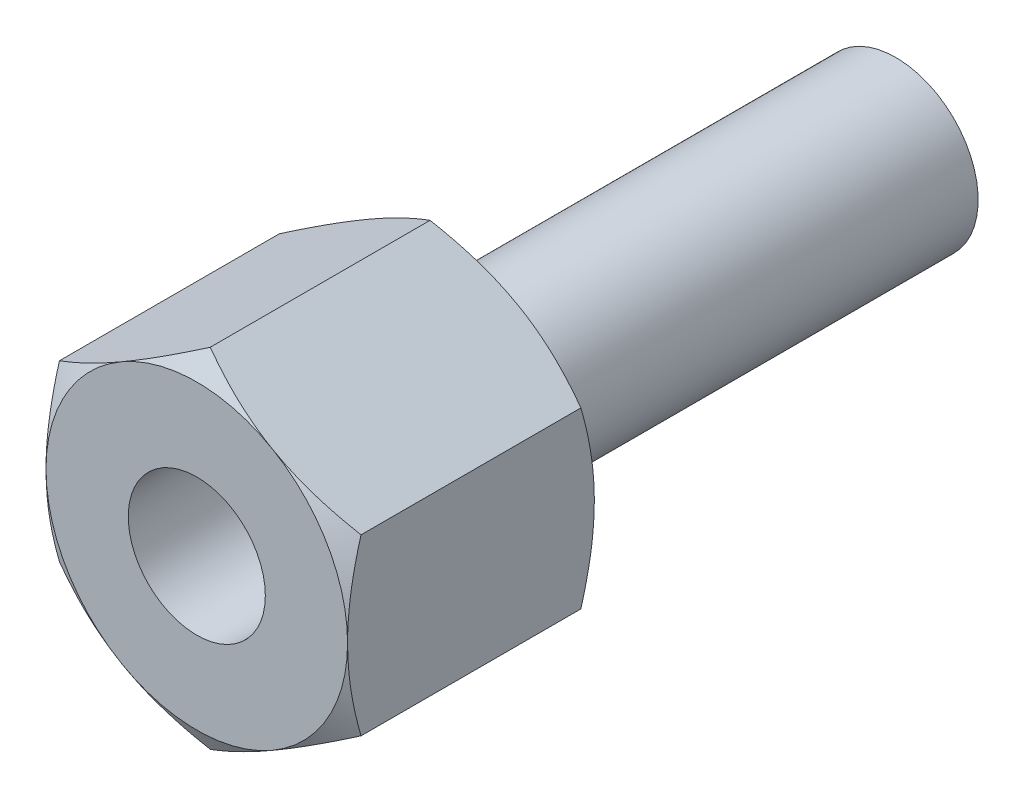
ISO-10303-21;
HEADER;
FILE_DESCRIPTION(('STEP AP214'),'2;1');
FILE_NAME('part.step','',(''),(''),'','','');
FILE_SCHEMA(('AUTOMOTIVE_DESIGN { 1 0 10303 214 1 1 1 1 }'));
ENDSEC;
DATA;
#1=APPLICATION_CONTEXT('core data for automotive mechanical design processes');
#2=APPLICATION_PROTOCOL_DEFINITION('international standard','automotive_design',2000,#1);
#3=PRODUCT_CONTEXT('',#1,'mechanical');
#4=PRODUCT('Part','Part','',(#3));
#5=PRODUCT_RELATED_PRODUCT_CATEGORY('part','',(#4));
#6=PRODUCT_DEFINITION_FORMATION('','',#4);
#7=PRODUCT_DEFINITION_CONTEXT('part definition',#1,'design');
#8=PRODUCT_DEFINITION('design','',#6,#7);
#9=PRODUCT_DEFINITION_SHAPE('','',#8);
#10=(LENGTH_UNIT() NAMED_UNIT(*) SI_UNIT(.MILLI.,.METRE.));
#11=(NAMED_UNIT(*) PLANE_ANGLE_UNIT() SI_UNIT($,.RADIAN.));
#12=(NAMED_UNIT(*) SI_UNIT($,.STERADIAN.) SOLID_ANGLE_UNIT());
#13=UNCERTAINTY_MEASURE_WITH_UNIT(LENGTH_MEASURE(1.E-05),#10,'distance_accuracy_value','');
#14=(GEOMETRIC_REPRESENTATION_CONTEXT(3) GLOBAL_UNCERTAINTY_ASSIGNED_CONTEXT((#13)) GLOBAL_UNIT_ASSIGNED_CONTEXT((#10,
#11,#12)) REPRESENTATION_CONTEXT('',''));
#15=CARTESIAN_POINT('',(0.,0.,0.));
#16=DIRECTION('',(0.,0.,1.));
#17=DIRECTION('',(1.,0.,0.));
#18=AXIS2_PLACEMENT_3D('',#15,#16,#17);
#19=CARTESIAN_POINT('',(0.,12.7017059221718,18.));
#20=DIRECTION('',(0.5,-0.866025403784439,0.));
#21=DIRECTION('',(0.866025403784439,0.5,0.));
#22=AXIS2_PLACEMENT_3D('',#19,#20,#21);
#23=PLANE('',#22);
#24=CARTESIAN_POINT('',(-11.0002,6.35073749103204,0.982547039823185));
#25=CARTESIAN_POINT('',(-10.7583962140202,6.49034297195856,0.901959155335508));
#26=CARTESIAN_POINT('',(-10.515690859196,6.63046897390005,0.825028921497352));
#27=CARTESIAN_POINT('',(-10.0283338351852,6.91184468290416,0.679498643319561));
#28=CARTESIAN_POINT('',(-9.78368155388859,7.05309474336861,0.61090133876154));
#29=CARTESIAN_POINT('',(-9.04578263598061,7.47912088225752,0.418936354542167));
#30=CARTESIAN_POINT('',(-8.54962304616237,7.76557875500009,0.309747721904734));
#31=CARTESIAN_POINT('',(-7.80714296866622,8.19424982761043,0.181714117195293));
#32=CARTESIAN_POINT('',(-7.56304065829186,8.33518236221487,0.145242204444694));
#33=CARTESIAN_POINT('',(-7.07370581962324,8.61769996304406,0.084081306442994));
#34=CARTESIAN_POINT('',(-6.82847326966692,8.7592850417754,0.0593925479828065));
#35=CARTESIAN_POINT('',(-6.33759931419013,9.0426912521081,0.0224303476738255));
#36=CARTESIAN_POINT('',(-6.0919587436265,9.1845119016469,0.0101421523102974));
#37=CARTESIAN_POINT('',(-5.60044998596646,9.46828461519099,-0.0017570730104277));
#38=CARTESIAN_POINT('',(-5.35458180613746,9.61023667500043,-0.00136849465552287));
#39=CARTESIAN_POINT('',(-4.89492981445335,9.87561687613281,0.0112011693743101));
#40=CARTESIAN_POINT('',(-4.68111322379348,9.99906394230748,0.0218490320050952));
#41=CARTESIAN_POINT('',(-4.25397181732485,10.2456741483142,0.0525316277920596));
#42=CARTESIAN_POINT('',(-4.04064703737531,10.3688372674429,0.0725670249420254));
#43=CARTESIAN_POINT('',(-3.6146051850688,10.6148126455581,0.121675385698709));
#44=CARTESIAN_POINT('',(-3.4018887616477,10.7376245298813,0.150755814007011));
#45=CARTESIAN_POINT('',(-2.97745318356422,10.9826725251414,0.217443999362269));
#46=CARTESIAN_POINT('',(-2.76573409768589,11.1049085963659,0.255052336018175));
#47=CARTESIAN_POINT('',(-2.12304886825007,11.4759630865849,0.381619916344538));
#48=CARTESIAN_POINT('',(-1.69394387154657,11.7237069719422,0.48319945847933));
#49=CARTESIAN_POINT('',(-0.842132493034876,12.2155005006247,0.713743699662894));
#50=CARTESIAN_POINT('',(-0.419415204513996,12.4595564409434,0.842654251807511));
#51=CARTESIAN_POINT('',(0.000200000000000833,12.7018213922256,0.982547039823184));
#52=B_SPLINE_CURVE_WITH_KNOTS('',3,(#24,#25,#26,#27,#28,#29,#30,#31,#32,#33,#34,#35,#36,#37,#38,
#39,#40,#41,#42,#43,#44,#45,#46,#47,#48,#49,#50,#51),.UNSPECIFIED.,.F.,.F.,(4,2,2,2,2,2,2,2,2,2,
2,2,2,4),(0.,0.871755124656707,1.74379610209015,3.49159027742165,4.34403665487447,
5.19649943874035,6.0479468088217,6.89936787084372,7.64056020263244,8.38180496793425,
9.1236630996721,9.86557166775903,11.3820155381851,12.8954827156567),.UNSPECIFIED.);
#53=CARTESIAN_POINT('',(-11.,6.35085296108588,0.982480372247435));
#54=VERTEX_POINT('',#53);
#55=CARTESIAN_POINT('',(-5.5,9.52627944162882,0.));
#56=VERTEX_POINT('',#55);
#57=EDGE_CURVE('E319',#54,#56,#52,.T.);
#58=ORIENTED_EDGE('',*,*,#57,.F.);
#59=DIRECTION('',(0.,0.,-1.));
#60=VECTOR('',#59,1.);
#61=CARTESIAN_POINT('',(-11.,6.35085296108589,18.));
#62=LINE('',#61,#60);
#63=CARTESIAN_POINT('',(-11.,6.35085296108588,17.0175196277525));
#64=VERTEX_POINT('',#63);
#65=EDGE_CURVE('E239',#64,#54,#62,.T.);
#66=ORIENTED_EDGE('',*,*,#65,.F.);
#67=CARTESIAN_POINT('',(0.0002,12.7018213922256,17.0174529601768));
#68=CARTESIAN_POINT('',(-0.241603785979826,12.5622159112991,17.0980408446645));
#69=CARTESIAN_POINT('',(-0.484309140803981,12.4220899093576,17.1749710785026));
#70=CARTESIAN_POINT('',(-0.971666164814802,12.1407142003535,17.3205013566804));
#71=CARTESIAN_POINT('',(-1.21631844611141,11.999464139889,17.3890986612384));
#72=CARTESIAN_POINT('',(-1.95421736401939,11.5734380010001,17.5810636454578));
#73=CARTESIAN_POINT('',(-2.45037695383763,11.2869801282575,17.6902522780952));
#74=CARTESIAN_POINT('',(-3.19285703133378,10.8583090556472,17.8182858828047));
#75=CARTESIAN_POINT('',(-3.43695934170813,10.7173765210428,17.8547577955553));
#76=CARTESIAN_POINT('',(-3.92629418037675,10.4348589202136,17.915918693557));
#77=CARTESIAN_POINT('',(-4.17152673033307,10.2932738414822,17.9406074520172));
#78=CARTESIAN_POINT('',(-4.66240068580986,10.0098676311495,17.9775696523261));
#79=CARTESIAN_POINT('',(-4.90804125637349,9.86804698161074,17.9898578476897));
#80=CARTESIAN_POINT('',(-5.39955001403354,9.58427426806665,18.0017570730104));
#81=CARTESIAN_POINT('',(-5.64541819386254,9.44232220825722,18.0013684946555));
#82=CARTESIAN_POINT('',(-6.10507018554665,9.17694200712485,17.9887988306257));
#83=CARTESIAN_POINT('',(-6.31888677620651,9.05349494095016,17.9781509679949));
#84=CARTESIAN_POINT('',(-6.74602818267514,8.80688473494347,17.9474683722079));
#85=CARTESIAN_POINT('',(-6.95935296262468,8.68372161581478,17.9274329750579));
#86=CARTESIAN_POINT('',(-7.38539481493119,8.43774623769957,17.8783246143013));
#87=CARTESIAN_POINT('',(-7.59811123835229,8.31493435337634,17.849244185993));
#88=CARTESIAN_POINT('',(-8.02254681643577,8.06988635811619,17.7825560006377));
#89=CARTESIAN_POINT('',(-8.23426590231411,7.94765028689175,17.7449476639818));
#90=CARTESIAN_POINT('',(-8.87695113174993,7.57659579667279,17.6183800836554));
#91=CARTESIAN_POINT('',(-9.30605612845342,7.32885191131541,17.5168005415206));
#92=CARTESIAN_POINT('',(-10.1578675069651,6.8370583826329,17.2862563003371));
#93=CARTESIAN_POINT('',(-10.580584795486,6.59300244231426,17.1573457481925));
#94=CARTESIAN_POINT('',(-11.0002,6.35073749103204,17.0174529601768));
#95=B_SPLINE_CURVE_WITH_KNOTS('',3,(#67,#68,#69,#70,#71,#72,#73,#74,#75,#76,#77,#78,#79,#80,#81,
#82,#83,#84,#85,#86,#87,#88,#89,#90,#91,#92,#93,#94),.UNSPECIFIED.,.F.,.F.,(4,2,2,2,2,2,2,2,2,2,
2,2,2,4),(0.,0.871755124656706,1.74379610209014,3.49159027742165,4.34403665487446,
5.19649943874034,6.04794680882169,6.89936787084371,7.64056020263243,8.38180496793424,
9.1236630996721,9.86557166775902,11.3820155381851,12.8954827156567),.UNSPECIFIED.);
#96=CARTESIAN_POINT('',(-5.5,9.52627944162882,18.));
#97=VERTEX_POINT('',#96);
#98=EDGE_CURVE('E301',#97,#64,#95,.T.);
#99=ORIENTED_EDGE('',*,*,#98,.F.);
#100=CARTESIAN_POINT('',(0.,12.7017059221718,17.0175196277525));
#101=VERTEX_POINT('',#100);
#102=EDGE_CURVE('E300',#101,#97,#95,.T.);
#103=ORIENTED_EDGE('',*,*,#102,.F.);
#104=DIRECTION('',(0.,0.,-1.));
#105=VECTOR('',#104,1.);
#106=CARTESIAN_POINT('',(0.,12.7017059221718,18.));
#107=LINE('',#106,#105);
#108=CARTESIAN_POINT('',(0.,12.7017059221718,0.982480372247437));
#109=VERTEX_POINT('',#108);
#110=EDGE_CURVE('E242',#101,#109,#107,.T.);
#111=ORIENTED_EDGE('',*,*,#110,.T.);
#112=EDGE_CURVE('E174',#56,#109,#52,.T.);
#113=ORIENTED_EDGE('',*,*,#112,.F.);
#114=EDGE_LOOP('',(#58,#66,#99,#103,#111,#113));
#115=FACE_BOUND('',#114,.T.);
#116=ADVANCED_FACE('F14',(#115),#23,.F.);
#117=CARTESIAN_POINT('',(-11.,6.35085296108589,18.));
#118=DIRECTION('',(1.,0.,0.));
#119=DIRECTION('',(0.,0.,-1.));
#120=AXIS2_PLACEMENT_3D('',#117,#118,#119);
#121=PLANE('',#120);
#122=CARTESIAN_POINT('',(-11.,-17.1566412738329,5.41562965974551));
#123=CARTESIAN_POINT('',(-11.,-16.9160213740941,5.2986831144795));
#124=CARTESIAN_POINT('',(-11.,-16.6751217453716,5.18231238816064));
#125=CARTESIAN_POINT('',(-11.,-16.1927046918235,4.95085279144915));
#126=CARTESIAN_POINT('',(-11.,-15.9511872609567,4.83576393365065));
#127=CARTESIAN_POINT('',(-11.,-15.2255577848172,4.49258578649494));
#128=CARTESIAN_POINT('',(-11.,-14.7404382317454,4.26661887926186));
#129=CARTESIAN_POINT('',(-11.,-13.7643915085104,3.82049683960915));
#130=CARTESIAN_POINT('',(-11.,-13.2734471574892,3.60037920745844));
#131=CARTESIAN_POINT('',(-11.,-12.287688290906,3.16901863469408));
#132=CARTESIAN_POINT('',(-11.,-11.7928739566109,2.95777528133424));
#133=CARTESIAN_POINT('',(-11.,-10.7822208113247,2.53973825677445));
#134=CARTESIAN_POINT('',(-11.,-10.2662259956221,2.33331980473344));
#135=CARTESIAN_POINT('',(-11.,-9.22823198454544,1.9358698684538));
#136=CARTESIAN_POINT('',(-11.,-8.70623212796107,1.7448400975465));
#137=CARTESIAN_POINT('',(-11.,-7.65636039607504,1.38311425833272));
#138=CARTESIAN_POINT('',(-11.,-7.12850253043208,1.21237785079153));
#139=CARTESIAN_POINT('',(-11.,-6.06516548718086,0.896642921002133));
#140=CARTESIAN_POINT('',(-11.,-5.52968873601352,0.751636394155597));
#141=CARTESIAN_POINT('',(-11.,-4.72215058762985,0.559022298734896));
#142=CARTESIAN_POINT('',(-11.,-4.45300932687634,0.499100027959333));
#143=CARTESIAN_POINT('',(-11.,-3.91286984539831,0.388257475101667));
#144=CARTESIAN_POINT('',(-11.,-3.64187166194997,0.337337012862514));
#145=CARTESIAN_POINT('',(-11.,-3.09819803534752,0.245390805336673));
#146=CARTESIAN_POINT('',(-11.,-2.82552262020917,0.204364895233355));
#147=CARTESIAN_POINT('',(-11.,-2.27877549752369,0.133022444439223));
#148=CARTESIAN_POINT('',(-11.,-2.00470384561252,0.102705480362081));
#149=CARTESIAN_POINT('',(-11.,-1.45916784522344,0.0537687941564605));
#150=CARTESIAN_POINT('',(-11.,-1.18771698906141,0.0349995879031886));
#151=CARTESIAN_POINT('',(-11.,-0.644265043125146,0.00896248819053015));
#152=CARTESIAN_POINT('',(-11.,-0.372263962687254,0.00169440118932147));
#153=CARTESIAN_POINT('',(-11.,0.171801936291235,-0.00116712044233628));
#154=CARTESIAN_POINT('',(-11.,0.443866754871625,0.00323945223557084));
#155=CARTESIAN_POINT('',(-11.,0.987565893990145,0.0236182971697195));
#156=CARTESIAN_POINT('',(-11.,1.25920019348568,0.0395911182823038));
#157=CARTESIAN_POINT('',(-11.,1.9090989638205,0.0913029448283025));
#158=CARTESIAN_POINT('',(-11.,2.28694891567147,0.132367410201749));
#159=CARTESIAN_POINT('',(-11.,3.0398902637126,0.234657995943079));
#160=CARTESIAN_POINT('',(-11.,3.41498128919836,0.295886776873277));
#161=CARTESIAN_POINT('',(-11.,4.5356627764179,0.506576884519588));
#162=CARTESIAN_POINT('',(-11.,5.27625307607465,0.683005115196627));
#163=CARTESIAN_POINT('',(-11.,6.38373085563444,0.989532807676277));
#164=CARTESIAN_POINT('',(-11.,6.75634775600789,1.10012794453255));
#165=CARTESIAN_POINT('',(-11.,7.49796407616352,1.33295393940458));
#166=CARTESIAN_POINT('',(-11.,7.86696347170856,1.455184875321));
#167=CARTESIAN_POINT('',(-11.,8.60145755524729,1.70930903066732));
#168=CARTESIAN_POINT('',(-11.,8.96695331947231,1.84119916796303));
#169=CARTESIAN_POINT('',(-11.,9.69490703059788,2.11307513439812));
#170=CARTESIAN_POINT('',(-11.,10.0573650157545,2.25306086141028));
#171=CARTESIAN_POINT('',(-11.,10.9227806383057,2.59663947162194));
#172=CARTESIAN_POINT('',(-11.,11.4244608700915,2.80344425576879));
#173=CARTESIAN_POINT('',(-11.,12.423453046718,3.22737944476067));
#174=CARTESIAN_POINT('',(-11.,12.9207647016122,3.4445105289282));
#175=CARTESIAN_POINT('',(-11.,13.9118483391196,3.88699865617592));
#176=CARTESIAN_POINT('',(-11.,14.4056194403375,4.11235766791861));
#177=CARTESIAN_POINT('',(-11.,15.390102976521,4.56961456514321));
#178=CARTESIAN_POINT('',(-11.,15.8808154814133,4.80151230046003));
#179=CARTESIAN_POINT('',(-11.,16.8602622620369,5.27087650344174));
#180=CARTESIAN_POINT('',(-11.,17.3489935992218,5.50834909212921));
#181=CARTESIAN_POINT('',(-11.,18.3243203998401,5.98763999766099));
#182=CARTESIAN_POINT('',(-11.,18.8109158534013,6.22945833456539));
#183=CARTESIAN_POINT('',(-11.,19.7822364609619,6.71665180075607));
#184=CARTESIAN_POINT('',(-11.,20.2669618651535,6.96202643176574));
#185=CARTESIAN_POINT('',(-11.,21.234883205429,7.45577565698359));
#186=CARTESIAN_POINT('',(-11.,21.718079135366,7.70415026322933));
#187=CARTESIAN_POINT('',(-11.,23.0827445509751,8.41012232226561));
#188=CARTESIAN_POINT('',(-11.,23.9626910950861,8.87066354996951));
#189=CARTESIAN_POINT('',(-11.,25.7193135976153,9.79800716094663));
#190=CARTESIAN_POINT('',(-11.,26.5959894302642,10.2648097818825));
#191=CARTESIAN_POINT('',(-11.,28.3444930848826,11.2019718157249));
#192=CARTESIAN_POINT('',(-11.,29.2163275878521,11.6723187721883));
#193=CARTESIAN_POINT('',(-11.,30.5225416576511,12.3806118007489));
#194=CARTESIAN_POINT('',(-11.,30.9576777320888,12.6171648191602));
#195=CARTESIAN_POINT('',(-11.,31.827496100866,13.0911021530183));
#196=CARTESIAN_POINT('',(-11.,32.2621783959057,13.3284864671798));
#197=CARTESIAN_POINT('',(-11.,32.6966597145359,13.5662381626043));
#198=B_SPLINE_CURVE_WITH_KNOTS('',3,(#122,#123,#124,#125,#126,#127,#128,#129,#130,#131,#132,
#133,#134,#135,#136,#137,#138,#139,#140,#141,#142,#143,#144,#145,#146,#147,#148,#149,#150,#151,
#152,#153,#154,#155,#156,#157,#158,#159,#160,#161,#162,#163,#164,#165,#166,#167,#168,#169,#170,
#171,#172,#173,#174,#175,#176,#177,#178,#179,#180,#181,#182,#183,#184,#185,#186,#187,#188,#189,
#190,#191,#192,#193,#194,#195,#196,#197),.UNSPECIFIED.,.F.,.F.,(4,2,2,2,2,2,2,2,2,2,2,2,2,2,2,2,
2,2,2,2,2,2,2,2,2,2,2,2,2,2,2,2,2,2,2,2,2,4),(0.,0.802600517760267,1.60520891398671,
3.21065822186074,4.82468488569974,6.43863639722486,8.10570210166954,9.77295315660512,
11.436832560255,13.1001934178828,13.9272608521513,14.7543117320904,15.5813488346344,
16.4083532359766,17.2244136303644,18.0404602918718,18.8565074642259,19.6725933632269,
20.8121758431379,21.9519087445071,24.2325997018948,25.3985497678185,26.5645076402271,
27.7300950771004,28.8956678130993,30.523411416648,32.1512622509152,33.7795051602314,
35.4077107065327,37.037796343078,38.6678895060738,40.2977564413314,41.9276299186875,
44.9071280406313,47.8867395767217,50.858577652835,52.3444123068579,53.8302446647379),.UNSPECIFIED.);
#199=CARTESIAN_POINT('',(-11.,-6.35085296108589,0.982480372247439));
#200=VERTEX_POINT('',#199);
#201=CARTESIAN_POINT('',(-11.,0.,0.));
#202=VERTEX_POINT('',#201);
#203=EDGE_CURVE('E115',#200,#202,#198,.T.);
#204=ORIENTED_EDGE('',*,*,#203,.F.);
#205=DIRECTION('',(0.,0.,-1.));
#206=VECTOR('',#205,1.);
#207=CARTESIAN_POINT('',(-11.,-6.35085296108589,18.));
#208=LINE('',#207,#206);
#209=CARTESIAN_POINT('',(-11.,-6.35085296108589,17.0175196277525));
#210=VERTEX_POINT('',#209);
#211=EDGE_CURVE('E139',#210,#200,#208,.T.);
#212=ORIENTED_EDGE('',*,*,#211,.F.);
#213=CARTESIAN_POINT('',(-11.,-17.1566412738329,12.5843703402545));
#214=CARTESIAN_POINT('',(-11.,-16.9160213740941,12.7013168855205));
#215=CARTESIAN_POINT('',(-11.,-16.6751217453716,12.8176876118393));
#216=CARTESIAN_POINT('',(-11.,-16.1927046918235,13.0491472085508));
#217=CARTESIAN_POINT('',(-11.,-15.9511872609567,13.1642360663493));
#218=CARTESIAN_POINT('',(-11.,-15.2255577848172,13.507414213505));
#219=CARTESIAN_POINT('',(-11.,-14.7404382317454,13.7333811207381));
#220=CARTESIAN_POINT('',(-11.,-13.7643915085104,14.1795031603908));
#221=CARTESIAN_POINT('',(-11.,-13.2734471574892,14.3996207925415));
#222=CARTESIAN_POINT('',(-11.,-12.287688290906,14.8309813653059));
#223=CARTESIAN_POINT('',(-11.,-11.7928739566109,15.0422247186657));
#224=CARTESIAN_POINT('',(-11.,-10.7822208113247,15.4602617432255));
#225=CARTESIAN_POINT('',(-11.,-10.2662259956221,15.6666801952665));
#226=CARTESIAN_POINT('',(-11.,-9.22823198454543,16.0641301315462));
#227=CARTESIAN_POINT('',(-11.,-8.70623212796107,16.2551599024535));
#228=CARTESIAN_POINT('',(-11.,-7.65636039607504,16.6168857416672));
#229=CARTESIAN_POINT('',(-11.,-7.12850253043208,16.7876221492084));
#230=CARTESIAN_POINT('',(-11.,-6.06516548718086,17.1033570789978));
#231=CARTESIAN_POINT('',(-11.,-5.52968873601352,17.2483636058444));
#232=CARTESIAN_POINT('',(-11.,-4.72215058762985,17.4409777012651));
#233=CARTESIAN_POINT('',(-11.,-4.45300932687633,17.5008999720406));
#234=CARTESIAN_POINT('',(-11.,-3.91286984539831,17.6117425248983));
#235=CARTESIAN_POINT('',(-11.,-3.64187166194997,17.6626629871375));
#236=CARTESIAN_POINT('',(-11.,-3.09819803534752,17.7546091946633));
#237=CARTESIAN_POINT('',(-11.,-2.82552262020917,17.7956351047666));
#238=CARTESIAN_POINT('',(-11.,-2.27877549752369,17.8669775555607));
#239=CARTESIAN_POINT('',(-11.,-2.00470384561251,17.8972945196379));
#240=CARTESIAN_POINT('',(-11.,-1.45916784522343,17.9462312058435));
#241=CARTESIAN_POINT('',(-11.,-1.18771698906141,17.9650004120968));
#242=CARTESIAN_POINT('',(-11.,-0.644265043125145,17.9910375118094));
#243=CARTESIAN_POINT('',(-11.,-0.372263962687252,17.9983055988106));
#244=CARTESIAN_POINT('',(-11.,0.171801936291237,18.0011671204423));
#245=CARTESIAN_POINT('',(-11.,0.443866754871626,17.9967605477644));
#246=CARTESIAN_POINT('',(-11.,0.987565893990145,17.9763817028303));
#247=CARTESIAN_POINT('',(-11.,1.25920019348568,17.9604088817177));
#248=CARTESIAN_POINT('',(-11.,1.9090989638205,17.9086970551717));
#249=CARTESIAN_POINT('',(-11.,2.28694891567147,17.8676325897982));
#250=CARTESIAN_POINT('',(-11.,3.0398902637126,17.7653420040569));
#251=CARTESIAN_POINT('',(-11.,3.41498128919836,17.7041132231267));
#252=CARTESIAN_POINT('',(-11.,4.53566277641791,17.4934231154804));
#253=CARTESIAN_POINT('',(-11.,5.27625307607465,17.3169948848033));
#254=CARTESIAN_POINT('',(-11.,6.38373085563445,17.0104671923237));
#255=CARTESIAN_POINT('',(-11.,6.7563477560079,16.8998720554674));
#256=CARTESIAN_POINT('',(-11.,7.49796407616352,16.6670460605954));
#257=CARTESIAN_POINT('',(-11.,7.86696347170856,16.544815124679));
#258=CARTESIAN_POINT('',(-11.,8.60145755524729,16.2906909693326));
#259=CARTESIAN_POINT('',(-11.,8.96695331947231,16.1588008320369));
#260=CARTESIAN_POINT('',(-11.,9.69490703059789,15.8869248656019));
#261=CARTESIAN_POINT('',(-11.,10.0573650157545,15.7469391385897));
#262=CARTESIAN_POINT('',(-11.,10.9227806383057,15.4033605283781));
#263=CARTESIAN_POINT('',(-11.,11.4244608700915,15.1965557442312));
#264=CARTESIAN_POINT('',(-11.,12.423453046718,14.7726205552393));
#265=CARTESIAN_POINT('',(-11.,12.9207647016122,14.5554894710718));
#266=CARTESIAN_POINT('',(-11.,13.9118483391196,14.1130013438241));
#267=CARTESIAN_POINT('',(-11.,14.4056194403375,13.8876423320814));
#268=CARTESIAN_POINT('',(-11.,15.390102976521,13.4303854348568));
#269=CARTESIAN_POINT('',(-11.,15.8808154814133,13.1984876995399));
#270=CARTESIAN_POINT('',(-11.,16.8602622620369,12.7291234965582));
#271=CARTESIAN_POINT('',(-11.,17.3489935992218,12.4916509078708));
#272=CARTESIAN_POINT('',(-11.,18.3243203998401,12.012360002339));
#273=CARTESIAN_POINT('',(-11.,18.8109158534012,11.7705416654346));
#274=CARTESIAN_POINT('',(-11.,19.7822364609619,11.2833481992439));
#275=CARTESIAN_POINT('',(-11.,20.2669618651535,11.0379735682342));
#276=CARTESIAN_POINT('',(-11.,21.234883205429,10.5442243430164));
#277=CARTESIAN_POINT('',(-11.,21.718079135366,10.2958497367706));
#278=CARTESIAN_POINT('',(-11.,23.0827445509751,9.58987767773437));
#279=CARTESIAN_POINT('',(-11.,23.9626910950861,9.12933645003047));
#280=CARTESIAN_POINT('',(-11.,25.7193135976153,8.20199283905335));
#281=CARTESIAN_POINT('',(-11.,26.5959894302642,7.73519021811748));
#282=CARTESIAN_POINT('',(-11.,28.3444930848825,6.79802818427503));
#283=CARTESIAN_POINT('',(-11.,29.2163275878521,6.32768122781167));
#284=CARTESIAN_POINT('',(-11.,30.5225416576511,5.61938819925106));
#285=CARTESIAN_POINT('',(-11.,30.9576777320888,5.38283518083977));
#286=CARTESIAN_POINT('',(-11.,31.827496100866,4.90889784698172));
#287=CARTESIAN_POINT('',(-11.,32.2621783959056,4.67151353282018));
#288=CARTESIAN_POINT('',(-11.,32.6966597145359,4.4337618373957));
#289=B_SPLINE_CURVE_WITH_KNOTS('',3,(#213,#214,#215,#216,#217,#218,#219,#220,#221,#222,#223,
#224,#225,#226,#227,#228,#229,#230,#231,#232,#233,#234,#235,#236,#237,#238,#239,#240,#241,#242,
#243,#244,#245,#246,#247,#248,#249,#250,#251,#252,#253,#254,#255,#256,#257,#258,#259,#260,#261,
#262,#263,#264,#265,#266,#267,#268,#269,#270,#271,#272,#273,#274,#275,#276,#277,#278,#279,#280,
#281,#282,#283,#284,#285,#286,#287,#288),.UNSPECIFIED.,.F.,.F.,(4,2,2,2,2,2,2,2,2,2,2,2,2,2,2,2,
2,2,2,2,2,2,2,2,2,2,2,2,2,2,2,2,2,2,2,2,2,4),(0.,0.802600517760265,1.6052089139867,
3.21065822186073,4.82468488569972,6.43863639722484,8.10570210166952,9.7729531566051,
11.4368325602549,13.1001934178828,13.9272608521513,14.7543117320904,15.5813488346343,
16.4083532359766,17.2244136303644,18.0404602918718,18.8565074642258,19.6725933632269,
20.8121758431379,21.9519087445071,24.2325997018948,25.3985497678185,26.5645076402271,
27.7300950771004,28.8956678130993,30.523411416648,32.1512622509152,33.7795051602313,
35.4077107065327,37.037796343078,38.6678895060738,40.2977564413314,41.9276299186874,
44.9071280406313,47.8867395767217,50.8585776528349,52.3444123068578,53.8302446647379),.UNSPECIFIED.);
#290=CARTESIAN_POINT('',(-11.,0.,18.));
#291=VERTEX_POINT('',#290);
#292=EDGE_CURVE('E207',#291,#210,#289,.F.);
#293=ORIENTED_EDGE('',*,*,#292,.F.);
#294=EDGE_CURVE('E286',#64,#291,#289,.F.);
#295=ORIENTED_EDGE('',*,*,#294,.F.);
#296=ORIENTED_EDGE('',*,*,#65,.T.);
#297=EDGE_CURVE('E133',#202,#54,#198,.T.);
#298=ORIENTED_EDGE('',*,*,#297,.F.);
#299=EDGE_LOOP('',(#204,#212,#293,#295,#296,#298));
#300=FACE_BOUND('',#299,.T.);
#301=ADVANCED_FACE('F193',(#300),#121,.F.);
#302=CARTESIAN_POINT('',(-11.,-6.35085296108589,18.));
#303=DIRECTION('',(0.5,0.866025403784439,0.));
#304=DIRECTION('',(-0.866025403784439,0.5,0.));
#305=AXIS2_PLACEMENT_3D('',#302,#303,#304);
#306=PLANE('',#305);
#307=CARTESIAN_POINT('',(0.000199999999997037,-12.7018213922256,0.982547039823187));
#308=CARTESIAN_POINT('',(-0.24160378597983,-12.5622159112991,0.901959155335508));
#309=CARTESIAN_POINT('',(-0.484309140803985,-12.4220899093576,0.825028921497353));
#310=CARTESIAN_POINT('',(-0.971666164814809,-12.1407142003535,0.679498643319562));
#311=CARTESIAN_POINT('',(-1.21631844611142,-11.999464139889,0.610901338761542));
#312=CARTESIAN_POINT('',(-1.9542173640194,-11.5734380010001,0.418936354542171));
#313=CARTESIAN_POINT('',(-2.45037695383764,-11.2869801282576,0.309747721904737));
#314=CARTESIAN_POINT('',(-3.19285703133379,-10.8583090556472,0.181714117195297));
#315=CARTESIAN_POINT('',(-3.43695934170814,-10.7173765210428,0.145242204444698));
#316=CARTESIAN_POINT('',(-3.92629418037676,-10.4348589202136,0.0840813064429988));
#317=CARTESIAN_POINT('',(-4.17152673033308,-10.2932738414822,0.0593925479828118));
#318=CARTESIAN_POINT('',(-4.66240068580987,-10.0098676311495,0.0224303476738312));
#319=CARTESIAN_POINT('',(-4.9080412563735,-9.86804698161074,0.010142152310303));
#320=CARTESIAN_POINT('',(-5.39955001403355,-9.58427426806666,-0.00175707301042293));
#321=CARTESIAN_POINT('',(-5.64541819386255,-9.44232220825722,-0.00136849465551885));
#322=CARTESIAN_POINT('',(-6.10507018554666,-9.17694200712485,0.0112011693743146));
#323=CARTESIAN_POINT('',(-6.31888677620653,-9.05349494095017,0.0218490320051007));
#324=CARTESIAN_POINT('',(-6.74602818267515,-8.80688473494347,0.0525316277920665));
#325=CARTESIAN_POINT('',(-6.95935296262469,-8.68372161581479,0.0725670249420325));
#326=CARTESIAN_POINT('',(-7.3853948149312,-8.43774623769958,0.121675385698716));
#327=CARTESIAN_POINT('',(-7.5981112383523,-8.31493435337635,0.150755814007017));
#328=CARTESIAN_POINT('',(-8.02254681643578,-8.0698863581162,0.217443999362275));
#329=CARTESIAN_POINT('',(-8.23426590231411,-7.94765028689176,0.255052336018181));
#330=CARTESIAN_POINT('',(-8.87695113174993,-7.57659579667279,0.381619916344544));
#331=CARTESIAN_POINT('',(-9.30605612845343,-7.32885191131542,0.483199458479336));
#332=CARTESIAN_POINT('',(-10.1578675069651,-6.83705838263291,0.713743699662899));
#333=CARTESIAN_POINT('',(-10.580584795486,-6.59300244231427,0.842654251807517));
#334=CARTESIAN_POINT('',(-11.0002,-6.35073749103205,0.982547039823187));
#335=B_SPLINE_CURVE_WITH_KNOTS('',3,(#307,#308,#309,#310,#311,#312,#313,#314,#315,#316,#317,
#318,#319,#320,#321,#322,#323,#324,#325,#326,#327,#328,#329,#330,#331,#332,#333,#334),
.UNSPECIFIED.,.F.,.F.,(4,2,2,2,2,2,2,2,2,2,2,2,2,4),(0.,0.871755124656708,1.74379610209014,
3.49159027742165,4.34403665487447,5.19649943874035,6.04794680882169,6.89936787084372,
7.64056020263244,8.38180496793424,9.1236630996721,9.86557166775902,11.3820155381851,
12.8954827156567),.UNSPECIFIED.);
#336=CARTESIAN_POINT('',(0.,-12.7017059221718,0.982480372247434));
#337=VERTEX_POINT('',#336);
#338=CARTESIAN_POINT('',(-5.5,-9.52627944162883,0.));
#339=VERTEX_POINT('',#338);
#340=EDGE_CURVE('E125',#337,#339,#335,.T.);
#341=ORIENTED_EDGE('',*,*,#340,.F.);
#342=DIRECTION('',(0.,0.,-1.));
#343=VECTOR('',#342,1.);
#344=CARTESIAN_POINT('',(0.,-12.7017059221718,18.));
#345=LINE('',#344,#343);
#346=CARTESIAN_POINT('',(0.,-12.7017059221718,17.0175196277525));
#347=VERTEX_POINT('',#346);
#348=EDGE_CURVE('E236',#347,#337,#345,.T.);
#349=ORIENTED_EDGE('',*,*,#348,.F.);
#350=CARTESIAN_POINT('',(-11.0002,-6.35073749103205,17.0174529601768));
#351=CARTESIAN_POINT('',(-10.7583962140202,-6.49034297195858,17.0980408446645));
#352=CARTESIAN_POINT('',(-10.515690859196,-6.63046897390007,17.1749710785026));
#353=CARTESIAN_POINT('',(-10.0283338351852,-6.91184468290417,17.3205013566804));
#354=CARTESIAN_POINT('',(-9.78368155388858,-7.05309474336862,17.3890986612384));
#355=CARTESIAN_POINT('',(-9.0457826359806,-7.47912088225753,17.5810636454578));
#356=CARTESIAN_POINT('',(-8.54962304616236,-7.76557875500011,17.6902522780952));
#357=CARTESIAN_POINT('',(-7.80714296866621,-8.19424982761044,17.8182858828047));
#358=CARTESIAN_POINT('',(-7.56304065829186,-8.33518236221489,17.8547577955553));
#359=CARTESIAN_POINT('',(-7.07370581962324,-8.61769996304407,17.915918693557));
#360=CARTESIAN_POINT('',(-6.82847326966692,-8.75928504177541,17.9406074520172));
#361=CARTESIAN_POINT('',(-6.33759931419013,-9.04269125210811,17.9775696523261));
#362=CARTESIAN_POINT('',(-6.0919587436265,-9.18451190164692,17.9898578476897));
#363=CARTESIAN_POINT('',(-5.60044998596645,-9.46828461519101,18.0017570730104));
#364=CARTESIAN_POINT('',(-5.35458180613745,-9.61023667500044,18.0013684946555));
#365=CARTESIAN_POINT('',(-4.89492981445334,-9.87561687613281,17.9887988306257));
#366=CARTESIAN_POINT('',(-4.68111322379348,-9.99906394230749,17.9781509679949));
#367=CARTESIAN_POINT('',(-4.25397181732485,-10.2456741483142,17.9474683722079));
#368=CARTESIAN_POINT('',(-4.04064703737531,-10.3688372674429,17.9274329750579));
#369=CARTESIAN_POINT('',(-3.6146051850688,-10.6148126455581,17.8783246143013));
#370=CARTESIAN_POINT('',(-3.4018887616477,-10.7376245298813,17.849244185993));
#371=CARTESIAN_POINT('',(-2.97745318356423,-10.9826725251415,17.7825560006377));
#372=CARTESIAN_POINT('',(-2.76573409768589,-11.1049085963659,17.7449476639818));
#373=CARTESIAN_POINT('',(-2.12304886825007,-11.4759630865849,17.6183800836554));
#374=CARTESIAN_POINT('',(-1.69394387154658,-11.7237069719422,17.5168005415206));
#375=CARTESIAN_POINT('',(-0.842132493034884,-12.2155005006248,17.2862563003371));
#376=CARTESIAN_POINT('',(-0.419415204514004,-12.4595564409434,17.1573457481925));
#377=CARTESIAN_POINT('',(0.000199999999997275,-12.7018213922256,17.0174529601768));
#378=B_SPLINE_CURVE_WITH_KNOTS('',3,(#350,#351,#352,#353,#354,#355,#356,#357,#358,#359,#360,
#361,#362,#363,#364,#365,#366,#367,#368,#369,#370,#371,#372,#373,#374,#375,#376,#377),
.UNSPECIFIED.,.F.,.F.,(4,2,2,2,2,2,2,2,2,2,2,2,2,4),(0.,0.871755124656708,1.74379610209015,
3.49159027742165,4.34403665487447,5.19649943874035,6.0479468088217,6.89936787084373,
7.64056020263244,8.38180496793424,9.1236630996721,9.86557166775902,11.3820155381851,
12.8954827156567),.UNSPECIFIED.);
#379=CARTESIAN_POINT('',(-5.5,-9.52627944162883,18.));
#380=VERTEX_POINT('',#379);
#381=EDGE_CURVE('E208',#380,#347,#378,.T.);
#382=ORIENTED_EDGE('',*,*,#381,.F.);
#383=EDGE_CURVE('E198',#210,#380,#378,.T.);
#384=ORIENTED_EDGE('',*,*,#383,.F.);
#385=ORIENTED_EDGE('',*,*,#211,.T.);
#386=EDGE_CURVE('E113',#339,#200,#335,.T.);
#387=ORIENTED_EDGE('',*,*,#386,.F.);
#388=EDGE_LOOP('',(#341,#349,#382,#384,#385,#387));
#389=FACE_BOUND('',#388,.T.);
#390=ADVANCED_FACE('F136',(#389),#306,.F.);
#391=CARTESIAN_POINT('',(0.,-12.7017059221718,18.));
#392=DIRECTION('',(-0.5,0.866025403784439,0.));
#393=DIRECTION('',(-0.866025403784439,-0.5,0.));
#394=AXIS2_PLACEMENT_3D('',#391,#392,#393);
#395=PLANE('',#394);
#396=CARTESIAN_POINT('',(11.0002,-6.35073749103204,0.982547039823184));
#397=CARTESIAN_POINT('',(10.7583962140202,-6.49034297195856,0.901959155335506));
#398=CARTESIAN_POINT('',(10.515690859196,-6.63046897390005,0.825028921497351));
#399=CARTESIAN_POINT('',(10.0283338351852,-6.91184468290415,0.679498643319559));
#400=CARTESIAN_POINT('',(9.78368155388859,-7.05309474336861,0.610901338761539));
#401=CARTESIAN_POINT('',(9.04578263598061,-7.47912088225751,0.418936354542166));
#402=CARTESIAN_POINT('',(8.54962304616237,-7.76557875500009,0.309747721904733));
#403=CARTESIAN_POINT('',(7.80714296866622,-8.19424982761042,0.181714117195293));
#404=CARTESIAN_POINT('',(7.56304065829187,-8.33518236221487,0.145242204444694));
#405=CARTESIAN_POINT('',(7.07370581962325,-8.61769996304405,0.0840813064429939));
#406=CARTESIAN_POINT('',(6.82847326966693,-8.7592850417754,0.0593925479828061));
#407=CARTESIAN_POINT('',(6.33759931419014,-9.0426912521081,0.0224303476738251));
#408=CARTESIAN_POINT('',(6.09195874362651,-9.1845119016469,0.0101421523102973));
#409=CARTESIAN_POINT('',(5.60044998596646,-9.46828461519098,-0.00175707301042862));
#410=CARTESIAN_POINT('',(5.35458180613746,-9.61023667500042,-0.00136849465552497));
#411=CARTESIAN_POINT('',(4.89492981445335,-9.8756168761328,0.0112011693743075));
#412=CARTESIAN_POINT('',(4.68111322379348,-9.99906394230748,0.021849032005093));
#413=CARTESIAN_POINT('',(4.25397181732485,-10.2456741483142,0.0525316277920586));
#414=CARTESIAN_POINT('',(4.04064703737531,-10.3688372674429,0.0725670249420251));
#415=CARTESIAN_POINT('',(3.6146051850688,-10.6148126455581,0.121675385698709));
#416=CARTESIAN_POINT('',(3.4018887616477,-10.7376245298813,0.150755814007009));
#417=CARTESIAN_POINT('',(2.97745318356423,-10.9826725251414,0.217443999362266));
#418=CARTESIAN_POINT('',(2.76573409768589,-11.1049085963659,0.255052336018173));
#419=CARTESIAN_POINT('',(2.12304886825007,-11.4759630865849,0.381619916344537));
#420=CARTESIAN_POINT('',(1.69394387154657,-11.7237069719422,0.483199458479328));
#421=CARTESIAN_POINT('',(0.842132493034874,-12.2155005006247,0.713743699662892));
#422=CARTESIAN_POINT('',(0.419415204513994,-12.4595564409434,0.84265425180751));
#423=CARTESIAN_POINT('',(-0.000200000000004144,-12.7018213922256,0.982547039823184));
#424=B_SPLINE_CURVE_WITH_KNOTS('',3,(#396,#397,#398,#399,#400,#401,#402,#403,#404,#405,#406,
#407,#408,#409,#410,#411,#412,#413,#414,#415,#416,#417,#418,#419,#420,#421,#422,#423),
.UNSPECIFIED.,.F.,.F.,(4,2,2,2,2,2,2,2,2,2,2,2,2,4),(0.,0.871755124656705,1.74379610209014,
3.49159027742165,4.34403665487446,5.19649943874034,6.04794680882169,6.89936787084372,
7.64056020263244,8.38180496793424,9.1236630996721,9.86557166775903,11.3820155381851,
12.8954827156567),.UNSPECIFIED.);
#425=CARTESIAN_POINT('',(11.,-6.35085296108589,0.982480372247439));
#426=VERTEX_POINT('',#425);
#427=CARTESIAN_POINT('',(5.5,-9.52627944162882,0.));
#428=VERTEX_POINT('',#427);
#429=EDGE_CURVE('E153',#426,#428,#424,.T.);
#430=ORIENTED_EDGE('',*,*,#429,.F.);
#431=DIRECTION('',(0.,0.,-1.));
#432=VECTOR('',#431,1.);
#433=CARTESIAN_POINT('',(11.,-6.35085296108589,18.));
#434=LINE('',#433,#432);
#435=CARTESIAN_POINT('',(11.,-6.35085296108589,17.0175196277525));
#436=VERTEX_POINT('',#435);
#437=EDGE_CURVE('E233',#436,#426,#434,.T.);
#438=ORIENTED_EDGE('',*,*,#437,.F.);
#439=CARTESIAN_POINT('',(-0.000200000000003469,-12.7018213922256,17.0174529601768));
#440=CARTESIAN_POINT('',(0.241603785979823,-12.5622159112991,17.0980408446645));
#441=CARTESIAN_POINT('',(0.484309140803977,-12.4220899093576,17.1749710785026));
#442=CARTESIAN_POINT('',(0.971666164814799,-12.1407142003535,17.3205013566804));
#443=CARTESIAN_POINT('',(1.21631844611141,-11.999464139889,17.3890986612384));
#444=CARTESIAN_POINT('',(1.95421736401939,-11.5734380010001,17.5810636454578));
#445=CARTESIAN_POINT('',(2.45037695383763,-11.2869801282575,17.6902522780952));
#446=CARTESIAN_POINT('',(3.19285703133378,-10.8583090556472,17.8182858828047));
#447=CARTESIAN_POINT('',(3.43695934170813,-10.7173765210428,17.8547577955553));
#448=CARTESIAN_POINT('',(3.92629418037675,-10.4348589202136,17.915918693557));
#449=CARTESIAN_POINT('',(4.17152673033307,-10.2932738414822,17.9406074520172));
#450=CARTESIAN_POINT('',(4.66240068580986,-10.0098676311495,17.9775696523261));
#451=CARTESIAN_POINT('',(4.90804125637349,-9.86804698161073,17.9898578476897));
#452=CARTESIAN_POINT('',(5.39955001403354,-9.58427426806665,18.0017570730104));
#453=CARTESIAN_POINT('',(5.64541819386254,-9.44232220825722,18.0013684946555));
#454=CARTESIAN_POINT('',(6.10507018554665,-9.17694200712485,17.9887988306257));
#455=CARTESIAN_POINT('',(6.31888677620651,-9.05349494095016,17.9781509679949));
#456=CARTESIAN_POINT('',(6.74602818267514,-8.80688473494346,17.9474683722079));
#457=CARTESIAN_POINT('',(6.95935296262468,-8.68372161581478,17.9274329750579));
#458=CARTESIAN_POINT('',(7.38539481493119,-8.43774623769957,17.8783246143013));
#459=CARTESIAN_POINT('',(7.59811123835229,-8.31493435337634,17.849244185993));
#460=CARTESIAN_POINT('',(8.02254681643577,-8.06988635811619,17.7825560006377));
#461=CARTESIAN_POINT('',(8.2342659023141,-7.94765028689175,17.7449476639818));
#462=CARTESIAN_POINT('',(8.87695113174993,-7.57659579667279,17.6183800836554));
#463=CARTESIAN_POINT('',(9.30605612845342,-7.32885191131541,17.5168005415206));
#464=CARTESIAN_POINT('',(10.1578675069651,-6.8370583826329,17.2862563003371));
#465=CARTESIAN_POINT('',(10.580584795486,-6.59300244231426,17.1573457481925));
#466=CARTESIAN_POINT('',(11.0002,-6.35073749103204,17.0174529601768));
#467=B_SPLINE_CURVE_WITH_KNOTS('',3,(#439,#440,#441,#442,#443,#444,#445,#446,#447,#448,#449,
#450,#451,#452,#453,#454,#455,#456,#457,#458,#459,#460,#461,#462,#463,#464,#465,#466),
.UNSPECIFIED.,.F.,.F.,(4,2,2,2,2,2,2,2,2,2,2,2,2,4),(0.,0.871755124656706,1.74379610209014,
3.49159027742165,4.34403665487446,5.19649943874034,6.04794680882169,6.89936787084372,
7.64056020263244,8.38180496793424,9.1236630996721,9.86557166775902,11.3820155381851,
12.8954827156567),.UNSPECIFIED.);
#468=CARTESIAN_POINT('',(5.5,-9.52627944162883,18.));
#469=VERTEX_POINT('',#468);
#470=EDGE_CURVE('E206',#469,#436,#467,.T.);
#471=ORIENTED_EDGE('',*,*,#470,.F.);
#472=EDGE_CURVE('E220',#347,#469,#467,.T.);
#473=ORIENTED_EDGE('',*,*,#472,.F.);
#474=ORIENTED_EDGE('',*,*,#348,.T.);
#475=EDGE_CURVE('E129',#428,#337,#424,.T.);
#476=ORIENTED_EDGE('',*,*,#475,.F.);
#477=EDGE_LOOP('',(#430,#438,#471,#473,#474,#476));
#478=FACE_BOUND('',#477,.T.);
#479=ADVANCED_FACE('F192',(#478),#395,.F.);
#480=CARTESIAN_POINT('',(11.,6.35085296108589,18.));
#481=DIRECTION('',(-0.5,-0.866025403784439,0.));
#482=DIRECTION('',(0.866025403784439,-0.5,0.));
#483=AXIS2_PLACEMENT_3D('',#480,#481,#482);
#484=PLANE('',#483);
#485=CARTESIAN_POINT('',(-0.0002,12.7018213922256,0.982547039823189));
#486=CARTESIAN_POINT('',(0.241603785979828,12.5622159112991,0.90195915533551));
#487=CARTESIAN_POINT('',(0.484309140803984,12.4220899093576,0.825028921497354));
#488=CARTESIAN_POINT('',(0.971666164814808,12.1407142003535,0.679498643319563));
#489=CARTESIAN_POINT('',(1.21631844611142,11.999464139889,0.610901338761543));
#490=CARTESIAN_POINT('',(1.9542173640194,11.5734380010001,0.418936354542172));
#491=CARTESIAN_POINT('',(2.45037695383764,11.2869801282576,0.309747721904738));
#492=CARTESIAN_POINT('',(3.19285703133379,10.8583090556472,0.181714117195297));
#493=CARTESIAN_POINT('',(3.43695934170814,10.7173765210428,0.145242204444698));
#494=CARTESIAN_POINT('',(3.92629418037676,10.4348589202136,0.0840813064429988));
#495=CARTESIAN_POINT('',(4.17152673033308,10.2932738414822,0.0593925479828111));
#496=CARTESIAN_POINT('',(4.66240068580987,10.0098676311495,0.0224303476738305));
#497=CARTESIAN_POINT('',(4.9080412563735,9.86804698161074,0.0101421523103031));
#498=CARTESIAN_POINT('',(5.39955001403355,9.58427426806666,-0.00175707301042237));
#499=CARTESIAN_POINT('',(5.64541819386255,9.44232220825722,-0.00136849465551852));
#500=CARTESIAN_POINT('',(6.10507018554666,9.17694200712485,0.011201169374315));
#501=CARTESIAN_POINT('',(6.31888677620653,9.05349494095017,0.0218490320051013));
#502=CARTESIAN_POINT('',(6.74602818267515,8.80688473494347,0.0525316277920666));
#503=CARTESIAN_POINT('',(6.95935296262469,8.68372161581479,0.0725670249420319));
#504=CARTESIAN_POINT('',(7.3853948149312,8.43774623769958,0.121675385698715));
#505=CARTESIAN_POINT('',(7.5981112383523,8.31493435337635,0.150755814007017));
#506=CARTESIAN_POINT('',(8.02254681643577,8.0698863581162,0.217443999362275));
#507=CARTESIAN_POINT('',(8.23426590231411,7.94765028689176,0.255052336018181));
#508=CARTESIAN_POINT('',(8.87695113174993,7.5765957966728,0.381619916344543));
#509=CARTESIAN_POINT('',(9.30605612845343,7.32885191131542,0.483199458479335));
#510=CARTESIAN_POINT('',(10.1578675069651,6.83705838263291,0.713743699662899));
#511=CARTESIAN_POINT('',(10.580584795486,6.59300244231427,0.842654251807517));
#512=CARTESIAN_POINT('',(11.0002,6.35073749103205,0.982547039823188));
#513=B_SPLINE_CURVE_WITH_KNOTS('',3,(#485,#486,#487,#488,#489,#490,#491,#492,#493,#494,#495,
#496,#497,#498,#499,#500,#501,#502,#503,#504,#505,#506,#507,#508,#509,#510,#511,#512),
.UNSPECIFIED.,.F.,.F.,(4,2,2,2,2,2,2,2,2,2,2,2,2,4),(0.,0.871755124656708,1.74379610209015,
3.49159027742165,4.34403665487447,5.19649943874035,6.0479468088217,6.89936787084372,
7.64056020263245,8.38180496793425,9.1236630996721,9.86557166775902,11.3820155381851,
12.8954827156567),.UNSPECIFIED.);
#514=CARTESIAN_POINT('',(5.5,9.52627944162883,0.));
#515=VERTEX_POINT('',#514);
#516=EDGE_CURVE('E152',#109,#515,#513,.T.);
#517=ORIENTED_EDGE('',*,*,#516,.F.);
#518=ORIENTED_EDGE('',*,*,#110,.F.);
#519=CARTESIAN_POINT('',(11.0002,6.35073749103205,17.0174529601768));
#520=CARTESIAN_POINT('',(10.7583962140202,6.49034297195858,17.0980408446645));
#521=CARTESIAN_POINT('',(10.515690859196,6.63046897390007,17.1749710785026));
#522=CARTESIAN_POINT('',(10.0283338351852,6.91184468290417,17.3205013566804));
#523=CARTESIAN_POINT('',(9.78368155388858,7.05309474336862,17.3890986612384));
#524=CARTESIAN_POINT('',(9.0457826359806,7.47912088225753,17.5810636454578));
#525=CARTESIAN_POINT('',(8.54962304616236,7.76557875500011,17.6902522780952));
#526=CARTESIAN_POINT('',(7.80714296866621,8.19424982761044,17.8182858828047));
#527=CARTESIAN_POINT('',(7.56304065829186,8.33518236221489,17.8547577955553));
#528=CARTESIAN_POINT('',(7.07370581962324,8.61769996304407,17.915918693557));
#529=CARTESIAN_POINT('',(6.82847326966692,8.75928504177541,17.9406074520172));
#530=CARTESIAN_POINT('',(6.33759931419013,9.04269125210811,17.9775696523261));
#531=CARTESIAN_POINT('',(6.0919587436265,9.18451190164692,17.9898578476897));
#532=CARTESIAN_POINT('',(5.60044998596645,9.46828461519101,18.0017570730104));
#533=CARTESIAN_POINT('',(5.35458180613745,9.61023667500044,18.0013684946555));
#534=CARTESIAN_POINT('',(4.89492981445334,9.87561687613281,17.9887988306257));
#535=CARTESIAN_POINT('',(4.68111322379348,9.99906394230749,17.9781509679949));
#536=CARTESIAN_POINT('',(4.25397181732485,10.2456741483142,17.9474683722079));
#537=CARTESIAN_POINT('',(4.04064703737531,10.3688372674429,17.9274329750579));
#538=CARTESIAN_POINT('',(3.6146051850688,10.6148126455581,17.8783246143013));
#539=CARTESIAN_POINT('',(3.4018887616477,10.7376245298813,17.849244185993));
#540=CARTESIAN_POINT('',(2.97745318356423,10.9826725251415,17.7825560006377));
#541=CARTESIAN_POINT('',(2.76573409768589,11.1049085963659,17.7449476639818));
#542=CARTESIAN_POINT('',(2.12304886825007,11.4759630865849,17.6183800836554));
#543=CARTESIAN_POINT('',(1.69394387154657,11.7237069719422,17.5168005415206));
#544=CARTESIAN_POINT('',(0.842132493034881,12.2155005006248,17.2862563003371));
#545=CARTESIAN_POINT('',(0.419415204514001,12.4595564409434,17.1573457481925));
#546=CARTESIAN_POINT('',(-0.00020000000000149,12.7018213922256,17.0174529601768));
#547=B_SPLINE_CURVE_WITH_KNOTS('',3,(#519,#520,#521,#522,#523,#524,#525,#526,#527,#528,#529,
#530,#531,#532,#533,#534,#535,#536,#537,#538,#539,#540,#541,#542,#543,#544,#545,#546),
.UNSPECIFIED.,.F.,.F.,(4,2,2,2,2,2,2,2,2,2,2,2,2,4),(0.,0.871755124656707,1.74379610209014,
3.49159027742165,4.34403665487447,5.19649943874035,6.0479468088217,6.89936787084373,
7.64056020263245,8.38180496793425,9.1236630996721,9.86557166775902,11.3820155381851,
12.8954827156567),.UNSPECIFIED.);
#548=CARTESIAN_POINT('',(5.5,9.52627944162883,18.));
#549=VERTEX_POINT('',#548);
#550=EDGE_CURVE('E290',#549,#101,#547,.T.);
#551=ORIENTED_EDGE('',*,*,#550,.F.);
#552=CARTESIAN_POINT('',(11.,6.35085296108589,17.0175196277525));
#553=VERTEX_POINT('',#552);
#554=EDGE_CURVE('E287',#553,#549,#547,.T.);
#555=ORIENTED_EDGE('',*,*,#554,.F.);
#556=DIRECTION('',(0.,0.,-1.));
#557=VECTOR('',#556,1.);
#558=CARTESIAN_POINT('',(11.,6.35085296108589,18.));
#559=LINE('',#558,#557);
#560=CARTESIAN_POINT('',(11.,6.35085296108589,0.982480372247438));
#561=VERTEX_POINT('',#560);
#562=EDGE_CURVE('E230',#553,#561,#559,.T.);
#563=ORIENTED_EDGE('',*,*,#562,.T.);
#564=EDGE_CURVE('E146',#515,#561,#513,.T.);
#565=ORIENTED_EDGE('',*,*,#564,.F.);
#566=EDGE_LOOP('',(#517,#518,#551,#555,#563,#565));
#567=FACE_BOUND('',#566,.T.);
#568=ADVANCED_FACE('F16',(#567),#484,.F.);
#569=CARTESIAN_POINT('',(11.,-6.35085296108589,18.));
#570=DIRECTION('',(-1.,0.,0.));
#571=DIRECTION('',(0.,0.,1.));
#572=AXIS2_PLACEMENT_3D('',#569,#570,#571);
#573=PLANE('',#572);
#574=CARTESIAN_POINT('',(11.,-17.1566412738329,5.41562965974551));
#575=CARTESIAN_POINT('',(11.,-16.9160213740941,5.2986831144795));
#576=CARTESIAN_POINT('',(11.,-16.6751217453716,5.18231238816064));
#577=CARTESIAN_POINT('',(11.,-16.1927046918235,4.95085279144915));
#578=CARTESIAN_POINT('',(11.,-15.9511872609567,4.83576393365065));
#579=CARTESIAN_POINT('',(11.,-15.2255577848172,4.49258578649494));
#580=CARTESIAN_POINT('',(11.,-14.7404382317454,4.26661887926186));
#581=CARTESIAN_POINT('',(11.,-13.7643915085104,3.82049683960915));
#582=CARTESIAN_POINT('',(11.,-13.2734471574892,3.60037920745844));
#583=CARTESIAN_POINT('',(11.,-12.287688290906,3.16901863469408));
#584=CARTESIAN_POINT('',(11.,-11.7928739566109,2.95777528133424));
#585=CARTESIAN_POINT('',(11.,-10.7822208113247,2.53973825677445));
#586=CARTESIAN_POINT('',(11.,-10.2662259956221,2.33331980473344));
#587=CARTESIAN_POINT('',(11.,-9.22823198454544,1.9358698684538));
#588=CARTESIAN_POINT('',(11.,-8.70623212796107,1.7448400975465));
#589=CARTESIAN_POINT('',(11.,-7.65636039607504,1.38311425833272));
#590=CARTESIAN_POINT('',(11.,-7.12850253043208,1.21237785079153));
#591=CARTESIAN_POINT('',(11.,-6.06516548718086,0.896642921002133));
#592=CARTESIAN_POINT('',(11.,-5.52968873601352,0.751636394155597));
#593=CARTESIAN_POINT('',(11.,-4.72215058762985,0.559022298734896));
#594=CARTESIAN_POINT('',(11.,-4.45300932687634,0.499100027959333));
#595=CARTESIAN_POINT('',(11.,-3.91286984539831,0.388257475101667));
#596=CARTESIAN_POINT('',(11.,-3.64187166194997,0.337337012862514));
#597=CARTESIAN_POINT('',(11.,-3.09819803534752,0.245390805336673));
#598=CARTESIAN_POINT('',(11.,-2.82552262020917,0.204364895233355));
#599=CARTESIAN_POINT('',(11.,-2.27877549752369,0.133022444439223));
#600=CARTESIAN_POINT('',(11.,-2.00470384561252,0.102705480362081));
#601=CARTESIAN_POINT('',(11.,-1.45916784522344,0.0537687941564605));
#602=CARTESIAN_POINT('',(11.,-1.18771698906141,0.0349995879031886));
#603=CARTESIAN_POINT('',(11.,-0.644265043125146,0.00896248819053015));
#604=CARTESIAN_POINT('',(11.,-0.372263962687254,0.00169440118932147));
#605=CARTESIAN_POINT('',(11.,0.171801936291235,-0.00116712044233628));
#606=CARTESIAN_POINT('',(11.,0.443866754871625,0.00323945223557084));
#607=CARTESIAN_POINT('',(11.,0.987565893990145,0.0236182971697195));
#608=CARTESIAN_POINT('',(11.,1.25920019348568,0.0395911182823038));
#609=CARTESIAN_POINT('',(11.,1.9090989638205,0.0913029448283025));
#610=CARTESIAN_POINT('',(11.,2.28694891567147,0.132367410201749));
#611=CARTESIAN_POINT('',(11.,3.0398902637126,0.234657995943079));
#612=CARTESIAN_POINT('',(11.,3.41498128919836,0.295886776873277));
#613=CARTESIAN_POINT('',(11.,4.5356627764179,0.506576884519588));
#614=CARTESIAN_POINT('',(11.,5.27625307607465,0.683005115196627));
#615=CARTESIAN_POINT('',(11.,6.38373085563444,0.989532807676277));
#616=CARTESIAN_POINT('',(11.,6.75634775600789,1.10012794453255));
#617=CARTESIAN_POINT('',(11.,7.49796407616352,1.33295393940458));
#618=CARTESIAN_POINT('',(11.,7.86696347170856,1.455184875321));
#619=CARTESIAN_POINT('',(11.,8.60145755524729,1.70930903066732));
#620=CARTESIAN_POINT('',(11.,8.96695331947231,1.84119916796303));
#621=CARTESIAN_POINT('',(11.,9.69490703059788,2.11307513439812));
#622=CARTESIAN_POINT('',(11.,10.0573650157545,2.25306086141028));
#623=CARTESIAN_POINT('',(11.,10.9227806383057,2.59663947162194));
#624=CARTESIAN_POINT('',(11.,11.4244608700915,2.80344425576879));
#625=CARTESIAN_POINT('',(11.,12.423453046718,3.22737944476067));
#626=CARTESIAN_POINT('',(11.,12.9207647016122,3.4445105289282));
#627=CARTESIAN_POINT('',(11.,13.9118483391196,3.88699865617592));
#628=CARTESIAN_POINT('',(11.,14.4056194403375,4.11235766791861));
#629=CARTESIAN_POINT('',(11.,15.390102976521,4.56961456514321));
#630=CARTESIAN_POINT('',(11.,15.8808154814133,4.80151230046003));
#631=CARTESIAN_POINT('',(11.,16.8602622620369,5.27087650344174));
#632=CARTESIAN_POINT('',(11.,17.3489935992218,5.50834909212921));
#633=CARTESIAN_POINT('',(11.,18.3243203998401,5.98763999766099));
#634=CARTESIAN_POINT('',(11.,18.8109158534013,6.22945833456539));
#635=CARTESIAN_POINT('',(11.,19.7822364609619,6.71665180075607));
#636=CARTESIAN_POINT('',(11.,20.2669618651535,6.96202643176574));
#637=CARTESIAN_POINT('',(11.,21.234883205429,7.45577565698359));
#638=CARTESIAN_POINT('',(11.,21.718079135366,7.70415026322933));
#639=CARTESIAN_POINT('',(11.,23.0827445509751,8.41012232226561));
#640=CARTESIAN_POINT('',(11.,23.9626910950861,8.87066354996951));
#641=CARTESIAN_POINT('',(11.,25.7193135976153,9.79800716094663));
#642=CARTESIAN_POINT('',(11.,26.5959894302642,10.2648097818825));
#643=CARTESIAN_POINT('',(11.,28.3444930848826,11.2019718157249));
#644=CARTESIAN_POINT('',(11.,29.2163275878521,11.6723187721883));
#645=CARTESIAN_POINT('',(11.,30.5225416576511,12.3806118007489));
#646=CARTESIAN_POINT('',(11.,30.9576777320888,12.6171648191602));
#647=CARTESIAN_POINT('',(11.,31.827496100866,13.0911021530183));
#648=CARTESIAN_POINT('',(11.,32.2621783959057,13.3284864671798));
#649=CARTESIAN_POINT('',(11.,32.6966597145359,13.5662381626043));
#650=B_SPLINE_CURVE_WITH_KNOTS('',3,(#574,#575,#576,#577,#578,#579,#580,#581,#582,#583,#584,
#585,#586,#587,#588,#589,#590,#591,#592,#593,#594,#595,#596,#597,#598,#599,#600,#601,#602,#603,
#604,#605,#606,#607,#608,#609,#610,#611,#612,#613,#614,#615,#616,#617,#618,#619,#620,#621,#622,
#623,#624,#625,#626,#627,#628,#629,#630,#631,#632,#633,#634,#635,#636,#637,#638,#639,#640,#641,
#642,#643,#644,#645,#646,#647,#648,#649),.UNSPECIFIED.,.F.,.F.,(4,2,2,2,2,2,2,2,2,2,2,2,2,2,2,2,
2,2,2,2,2,2,2,2,2,2,2,2,2,2,2,2,2,2,2,2,2,4),(0.,0.802600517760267,1.60520891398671,
3.21065822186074,4.82468488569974,6.43863639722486,8.10570210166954,9.77295315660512,
11.436832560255,13.1001934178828,13.9272608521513,14.7543117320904,15.5813488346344,
16.4083532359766,17.2244136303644,18.0404602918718,18.8565074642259,19.6725933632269,
20.8121758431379,21.9519087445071,24.2325997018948,25.3985497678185,26.5645076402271,
27.7300950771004,28.8956678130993,30.523411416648,32.1512622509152,33.7795051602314,
35.4077107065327,37.037796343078,38.6678895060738,40.2977564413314,41.9276299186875,
44.9071280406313,47.8867395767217,50.858577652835,52.3444123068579,53.8302446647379),.UNSPECIFIED.);
#651=CARTESIAN_POINT('',(11.,0.,0.));
#652=VERTEX_POINT('',#651);
#653=EDGE_CURVE('E9',#561,#652,#650,.F.);
#654=ORIENTED_EDGE('',*,*,#653,.F.);
#655=ORIENTED_EDGE('',*,*,#562,.F.);
#656=CARTESIAN_POINT('',(11.,-17.1566412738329,12.5843703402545));
#657=CARTESIAN_POINT('',(11.,-16.9160213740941,12.7013168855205));
#658=CARTESIAN_POINT('',(11.,-16.6751217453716,12.8176876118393));
#659=CARTESIAN_POINT('',(11.,-16.1927046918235,13.0491472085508));
#660=CARTESIAN_POINT('',(11.,-15.9511872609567,13.1642360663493));
#661=CARTESIAN_POINT('',(11.,-15.2255577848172,13.507414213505));
#662=CARTESIAN_POINT('',(11.,-14.7404382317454,13.7333811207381));
#663=CARTESIAN_POINT('',(11.,-13.7643915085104,14.1795031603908));
#664=CARTESIAN_POINT('',(11.,-13.2734471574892,14.3996207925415));
#665=CARTESIAN_POINT('',(11.,-12.287688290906,14.8309813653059));
#666=CARTESIAN_POINT('',(11.,-11.7928739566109,15.0422247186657));
#667=CARTESIAN_POINT('',(11.,-10.7822208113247,15.4602617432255));
#668=CARTESIAN_POINT('',(11.,-10.2662259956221,15.6666801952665));
#669=CARTESIAN_POINT('',(11.,-9.22823198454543,16.0641301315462));
#670=CARTESIAN_POINT('',(11.,-8.70623212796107,16.2551599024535));
#671=CARTESIAN_POINT('',(11.,-7.65636039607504,16.6168857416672));
#672=CARTESIAN_POINT('',(11.,-7.12850253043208,16.7876221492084));
#673=CARTESIAN_POINT('',(11.,-6.06516548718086,17.1033570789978));
#674=CARTESIAN_POINT('',(11.,-5.52968873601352,17.2483636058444));
#675=CARTESIAN_POINT('',(11.,-4.72215058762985,17.4409777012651));
#676=CARTESIAN_POINT('',(11.,-4.45300932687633,17.5008999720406));
#677=CARTESIAN_POINT('',(11.,-3.91286984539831,17.6117425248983));
#678=CARTESIAN_POINT('',(11.,-3.64187166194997,17.6626629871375));
#679=CARTESIAN_POINT('',(11.,-3.09819803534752,17.7546091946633));
#680=CARTESIAN_POINT('',(11.,-2.82552262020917,17.7956351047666));
#681=CARTESIAN_POINT('',(11.,-2.27877549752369,17.8669775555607));
#682=CARTESIAN_POINT('',(11.,-2.00470384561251,17.8972945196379));
#683=CARTESIAN_POINT('',(11.,-1.45916784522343,17.9462312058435));
#684=CARTESIAN_POINT('',(11.,-1.18771698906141,17.9650004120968));
#685=CARTESIAN_POINT('',(11.,-0.644265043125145,17.9910375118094));
#686=CARTESIAN_POINT('',(11.,-0.372263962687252,17.9983055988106));
#687=CARTESIAN_POINT('',(11.,0.171801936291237,18.0011671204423));
#688=CARTESIAN_POINT('',(11.,0.443866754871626,17.9967605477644));
#689=CARTESIAN_POINT('',(11.,0.987565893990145,17.9763817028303));
#690=CARTESIAN_POINT('',(11.,1.25920019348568,17.9604088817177));
#691=CARTESIAN_POINT('',(11.,1.9090989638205,17.9086970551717));
#692=CARTESIAN_POINT('',(11.,2.28694891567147,17.8676325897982));
#693=CARTESIAN_POINT('',(11.,3.0398902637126,17.7653420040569));
#694=CARTESIAN_POINT('',(11.,3.41498128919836,17.7041132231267));
#695=CARTESIAN_POINT('',(11.,4.53566277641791,17.4934231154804));
#696=CARTESIAN_POINT('',(11.,5.27625307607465,17.3169948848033));
#697=CARTESIAN_POINT('',(11.,6.38373085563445,17.0104671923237));
#698=CARTESIAN_POINT('',(11.,6.7563477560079,16.8998720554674));
#699=CARTESIAN_POINT('',(11.,7.49796407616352,16.6670460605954));
#700=CARTESIAN_POINT('',(11.,7.86696347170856,16.544815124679));
#701=CARTESIAN_POINT('',(11.,8.60145755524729,16.2906909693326));
#702=CARTESIAN_POINT('',(11.,8.96695331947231,16.1588008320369));
#703=CARTESIAN_POINT('',(11.,9.69490703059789,15.8869248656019));
#704=CARTESIAN_POINT('',(11.,10.0573650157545,15.7469391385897));
#705=CARTESIAN_POINT('',(11.,10.9227806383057,15.4033605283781));
#706=CARTESIAN_POINT('',(11.,11.4244608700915,15.1965557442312));
#707=CARTESIAN_POINT('',(11.,12.423453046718,14.7726205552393));
#708=CARTESIAN_POINT('',(11.,12.9207647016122,14.5554894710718));
#709=CARTESIAN_POINT('',(11.,13.9118483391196,14.1130013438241));
#710=CARTESIAN_POINT('',(11.,14.4056194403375,13.8876423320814));
#711=CARTESIAN_POINT('',(11.,15.390102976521,13.4303854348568));
#712=CARTESIAN_POINT('',(11.,15.8808154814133,13.1984876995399));
#713=CARTESIAN_POINT('',(11.,16.8602622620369,12.7291234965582));
#714=CARTESIAN_POINT('',(11.,17.3489935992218,12.4916509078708));
#715=CARTESIAN_POINT('',(11.,18.3243203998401,12.012360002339));
#716=CARTESIAN_POINT('',(11.,18.8109158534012,11.7705416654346));
#717=CARTESIAN_POINT('',(11.,19.7822364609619,11.2833481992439));
#718=CARTESIAN_POINT('',(11.,20.2669618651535,11.0379735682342));
#719=CARTESIAN_POINT('',(11.,21.234883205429,10.5442243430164));
#720=CARTESIAN_POINT('',(11.,21.718079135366,10.2958497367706));
#721=CARTESIAN_POINT('',(11.,23.0827445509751,9.58987767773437));
#722=CARTESIAN_POINT('',(11.,23.9626910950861,9.12933645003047));
#723=CARTESIAN_POINT('',(11.,25.7193135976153,8.20199283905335));
#724=CARTESIAN_POINT('',(11.,26.5959894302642,7.73519021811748));
#725=CARTESIAN_POINT('',(11.,28.3444930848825,6.79802818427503));
#726=CARTESIAN_POINT('',(11.,29.2163275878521,6.32768122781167));
#727=CARTESIAN_POINT('',(11.,30.5225416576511,5.61938819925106));
#728=CARTESIAN_POINT('',(11.,30.9576777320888,5.38283518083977));
#729=CARTESIAN_POINT('',(11.,31.827496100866,4.90889784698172));
#730=CARTESIAN_POINT('',(11.,32.2621783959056,4.67151353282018));
#731=CARTESIAN_POINT('',(11.,32.6966597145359,4.4337618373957));
#732=B_SPLINE_CURVE_WITH_KNOTS('',3,(#656,#657,#658,#659,#660,#661,#662,#663,#664,#665,#666,
#667,#668,#669,#670,#671,#672,#673,#674,#675,#676,#677,#678,#679,#680,#681,#682,#683,#684,#685,
#686,#687,#688,#689,#690,#691,#692,#693,#694,#695,#696,#697,#698,#699,#700,#701,#702,#703,#704,
#705,#706,#707,#708,#709,#710,#711,#712,#713,#714,#715,#716,#717,#718,#719,#720,#721,#722,#723,
#724,#725,#726,#727,#728,#729,#730,#731),.UNSPECIFIED.,.F.,.F.,(4,2,2,2,2,2,2,2,2,2,2,2,2,2,2,2,
2,2,2,2,2,2,2,2,2,2,2,2,2,2,2,2,2,2,2,2,2,4),(0.,0.802600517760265,1.6052089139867,
3.21065822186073,4.82468488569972,6.43863639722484,8.10570210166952,9.7729531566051,
11.4368325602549,13.1001934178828,13.9272608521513,14.7543117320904,15.5813488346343,
16.4083532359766,17.2244136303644,18.0404602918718,18.8565074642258,19.6725933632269,
20.8121758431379,21.9519087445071,24.2325997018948,25.3985497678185,26.5645076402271,
27.7300950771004,28.8956678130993,30.523411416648,32.1512622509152,33.7795051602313,
35.4077107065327,37.037796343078,38.6678895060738,40.2977564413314,41.9276299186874,
44.9071280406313,47.8867395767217,50.8585776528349,52.3444123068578,53.8302446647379),.UNSPECIFIED.);
#733=CARTESIAN_POINT('',(11.,0.,18.));
#734=VERTEX_POINT('',#733);
#735=EDGE_CURVE('E209',#734,#553,#732,.T.);
#736=ORIENTED_EDGE('',*,*,#735,.F.);
#737=EDGE_CURVE('E269',#436,#734,#732,.T.);
#738=ORIENTED_EDGE('',*,*,#737,.F.);
#739=ORIENTED_EDGE('',*,*,#437,.T.);
#740=EDGE_CURVE('E19',#652,#426,#650,.F.);
#741=ORIENTED_EDGE('',*,*,#740,.F.);
#742=EDGE_LOOP('',(#654,#655,#736,#738,#739,#741));
#743=FACE_BOUND('',#742,.T.);
#744=ADVANCED_FACE('F283',(#743),#573,.F.);
#745=CARTESIAN_POINT('',(11.,6.35085296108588,18.));
#746=DIRECTION('',(0.,0.,-1.));
#747=DIRECTION('',(-1.,0.,0.));
#748=AXIS2_PLACEMENT_3D('',#745,#746,#747);
#749=PLANE('',#748);
#750=CARTESIAN_POINT('',(0.,0.,18.));
#751=DIRECTION('',(0.,0.,1.));
#752=DIRECTION('',(1.,0.,0.));
#753=AXIS2_PLACEMENT_3D('',#750,#751,#752);
#754=CIRCLE('',#753,5.);
#755=CARTESIAN_POINT('',(5.,0.,18.));
#756=VERTEX_POINT('',#755);
#757=EDGE_CURVE('E224',#756,#756,#754,.T.);
#758=ORIENTED_EDGE('',*,*,#757,.F.);
#759=EDGE_LOOP('',(#758));
#760=FACE_BOUND('',#759,.T.);
#761=CARTESIAN_POINT('',(0.,0.,18.));
#762=DIRECTION('',(0.,0.,-1.));
#763=DIRECTION('',(-1.,0.,0.));
#764=AXIS2_PLACEMENT_3D('',#761,#762,#763);
#765=CIRCLE('',#764,11.);
#766=EDGE_CURVE('E250',#291,#97,#765,.T.);
#767=ORIENTED_EDGE('',*,*,#766,.F.);
#768=EDGE_CURVE('E247',#380,#291,#765,.T.);
#769=ORIENTED_EDGE('',*,*,#768,.F.);
#770=EDGE_CURVE('E249',#469,#380,#765,.T.);
#771=ORIENTED_EDGE('',*,*,#770,.F.);
#772=EDGE_CURVE('E254',#734,#469,#765,.T.);
#773=ORIENTED_EDGE('',*,*,#772,.F.);
#774=CARTESIAN_POINT('',(0.,0.,18.));
#775=DIRECTION('',(0.,0.,1.));
#776=DIRECTION('',(1.,0.,0.));
#777=AXIS2_PLACEMENT_3D('',#774,#775,#776);
#778=CIRCLE('',#777,11.);
#779=EDGE_CURVE('E140',#734,#549,#778,.T.);
#780=ORIENTED_EDGE('',*,*,#779,.T.);
#781=EDGE_CURVE('E256',#97,#549,#765,.T.);
#782=ORIENTED_EDGE('',*,*,#781,.F.);
#783=EDGE_LOOP('',(#767,#769,#771,#773,#780,#782));
#784=FACE_BOUND('',#783,.T.);
#785=ADVANCED_FACE('F273',(#760,#784),#749,.F.);
#786=CARTESIAN_POINT('',(4.25,0.,8.));
#787=DIRECTION('',(0.,0.,-1.));
#788=DIRECTION('',(-1.,0.,0.));
#789=AXIS2_PLACEMENT_3D('',#786,#787,#788);
#790=PLANE('',#789);
#791=CARTESIAN_POINT('',(0.,0.,8.));
#792=DIRECTION('',(0.,0.,1.));
#793=DIRECTION('',(1.,0.,0.));
#794=AXIS2_PLACEMENT_3D('',#791,#792,#793);
#795=CIRCLE('',#794,5.);
#796=CARTESIAN_POINT('',(5.,0.,8.));
#797=VERTEX_POINT('',#796);
#798=EDGE_CURVE('E227',#797,#797,#795,.T.);
#799=ORIENTED_EDGE('',*,*,#798,.T.);
#800=EDGE_LOOP('',(#799));
#801=FACE_BOUND('',#800,.T.);
#802=ADVANCED_FACE('F375',(#801),#790,.F.);
#803=CARTESIAN_POINT('',(0.,0.,18.));
#804=DIRECTION('',(0.,0.,1.));
#805=DIRECTION('',(1.,0.,0.));
#806=AXIS2_PLACEMENT_3D('',#803,#804,#805);
#807=CYLINDRICAL_SURFACE('',#806,5.);
#808=ORIENTED_EDGE('',*,*,#798,.F.);
#809=EDGE_LOOP('',(#808));
#810=FACE_BOUND('',#809,.T.);
#811=ORIENTED_EDGE('',*,*,#757,.T.);
#812=EDGE_LOOP('',(#811));
#813=FACE_BOUND('',#812,.T.);
#814=ADVANCED_FACE('F358',(#810,#813),#807,.F.);
#815=CARTESIAN_POINT('',(0.,0.,18.));
#816=DIRECTION('',(0.,0.,-1.));
#817=DIRECTION('',(-1.,0.,0.));
#818=AXIS2_PLACEMENT_3D('',#815,#816,#817);
#819=CONICAL_SURFACE('',#818,11.,1.0471975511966);
#820=ORIENTED_EDGE('',*,*,#383,.T.);
#821=ORIENTED_EDGE('',*,*,#768,.T.);
#822=ORIENTED_EDGE('',*,*,#292,.T.);
#823=EDGE_LOOP('',(#820,#821,#822));
#824=FACE_BOUND('',#823,.T.);
#825=ADVANCED_FACE('F352',(#824),#819,.T.);
#826=ORIENTED_EDGE('',*,*,#381,.T.);
#827=ORIENTED_EDGE('',*,*,#472,.T.);
#828=ORIENTED_EDGE('',*,*,#770,.T.);
#829=EDGE_LOOP('',(#826,#827,#828));
#830=FACE_BOUND('',#829,.T.);
#831=ADVANCED_FACE('F165',(#830),#819,.T.);
#832=ORIENTED_EDGE('',*,*,#470,.T.);
#833=ORIENTED_EDGE('',*,*,#737,.T.);
#834=ORIENTED_EDGE('',*,*,#772,.T.);
#835=EDGE_LOOP('',(#832,#833,#834));
#836=FACE_BOUND('',#835,.T.);
#837=ADVANCED_FACE('F266',(#836),#819,.T.);
#838=ORIENTED_EDGE('',*,*,#735,.T.);
#839=ORIENTED_EDGE('',*,*,#554,.T.);
#840=ORIENTED_EDGE('',*,*,#779,.F.);
#841=EDGE_LOOP('',(#838,#839,#840));
#842=FACE_BOUND('',#841,.T.);
#843=ADVANCED_FACE('F350',(#842),#819,.T.);
#844=ORIENTED_EDGE('',*,*,#550,.T.);
#845=ORIENTED_EDGE('',*,*,#102,.T.);
#846=ORIENTED_EDGE('',*,*,#781,.T.);
#847=EDGE_LOOP('',(#844,#845,#846));
#848=FACE_BOUND('',#847,.T.);
#849=ADVANCED_FACE('F345',(#848),#819,.T.);
#850=ORIENTED_EDGE('',*,*,#294,.T.);
#851=ORIENTED_EDGE('',*,*,#766,.T.);
#852=ORIENTED_EDGE('',*,*,#98,.T.);
#853=EDGE_LOOP('',(#850,#851,#852));
#854=FACE_BOUND('',#853,.T.);
#855=ADVANCED_FACE('F324',(#854),#819,.T.);
#856=CARTESIAN_POINT('',(0.,0.,3.22648125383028));
#857=DIRECTION('',(0.,0.,1.));
#858=DIRECTION('',(1.,0.,0.));
#859=AXIS2_PLACEMENT_3D('',#856,#857,#858);
#860=CONICAL_SURFACE('',#859,16.5884294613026,1.0471975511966);
#861=ORIENTED_EDGE('',*,*,#429,.T.);
#862=CARTESIAN_POINT('',(0.,0.,0.));
#863=DIRECTION('',(0.,0.,1.));
#864=DIRECTION('',(1.,0.,0.));
#865=AXIS2_PLACEMENT_3D('',#862,#863,#864);
#866=CIRCLE('',#865,11.);
#867=EDGE_CURVE('E144',#428,#652,#866,.T.);
#868=ORIENTED_EDGE('',*,*,#867,.T.);
#869=ORIENTED_EDGE('',*,*,#740,.T.);
#870=EDGE_LOOP('',(#861,#868,#869));
#871=FACE_BOUND('',#870,.T.);
#872=ADVANCED_FACE('F334',(#871),#860,.T.);
#873=ORIENTED_EDGE('',*,*,#564,.T.);
#874=ORIENTED_EDGE('',*,*,#653,.T.);
#875=EDGE_CURVE('E43',#652,#515,#866,.T.);
#876=ORIENTED_EDGE('',*,*,#875,.T.);
#877=EDGE_LOOP('',(#873,#874,#876));
#878=FACE_BOUND('',#877,.T.);
#879=ADVANCED_FACE('F164',(#878),#860,.T.);
#880=ORIENTED_EDGE('',*,*,#112,.T.);
#881=ORIENTED_EDGE('',*,*,#516,.T.);
#882=EDGE_CURVE('E36',#515,#56,#866,.T.);
#883=ORIENTED_EDGE('',*,*,#882,.T.);
#884=EDGE_LOOP('',(#880,#881,#883));
#885=FACE_BOUND('',#884,.T.);
#886=ADVANCED_FACE('F332',(#885),#860,.T.);
#887=ORIENTED_EDGE('',*,*,#340,.T.);
#888=EDGE_CURVE('E121',#339,#428,#866,.T.);
#889=ORIENTED_EDGE('',*,*,#888,.T.);
#890=ORIENTED_EDGE('',*,*,#475,.T.);
#891=EDGE_LOOP('',(#887,#889,#890));
#892=FACE_BOUND('',#891,.T.);
#893=ADVANCED_FACE('F126',(#892),#860,.T.);
#894=ORIENTED_EDGE('',*,*,#386,.T.);
#895=ORIENTED_EDGE('',*,*,#203,.T.);
#896=EDGE_CURVE('E109',#202,#339,#866,.T.);
#897=ORIENTED_EDGE('',*,*,#896,.T.);
#898=EDGE_LOOP('',(#894,#895,#897));
#899=FACE_BOUND('',#898,.T.);
#900=ADVANCED_FACE('F111',(#899),#860,.T.);
#901=ORIENTED_EDGE('',*,*,#297,.T.);
#902=ORIENTED_EDGE('',*,*,#57,.T.);
#903=EDGE_CURVE('E120',#56,#202,#866,.T.);
#904=ORIENTED_EDGE('',*,*,#903,.T.);
#905=EDGE_LOOP('',(#901,#902,#904));
#906=FACE_BOUND('',#905,.T.);
#907=ADVANCED_FACE('F163',(#906),#860,.T.);
#908=CARTESIAN_POINT('',(6.,0.,-33.));
#909=DIRECTION('',(0.,0.,1.));
#910=DIRECTION('',(1.,0.,0.));
#911=AXIS2_PLACEMENT_3D('',#908,#909,#910);
#912=PLANE('',#911);
#913=CARTESIAN_POINT('',(0.,0.,-33.));
#914=DIRECTION('',(0.,0.,-1.));
#915=DIRECTION('',(-1.,0.,0.));
#916=AXIS2_PLACEMENT_3D('',#913,#914,#915);
#917=CIRCLE('',#916,6.);
#918=CARTESIAN_POINT('',(-6.,0.,-33.));
#919=VERTEX_POINT('',#918);
#920=EDGE_CURVE('E221',#919,#919,#917,.T.);
#921=ORIENTED_EDGE('',*,*,#920,.T.);
#922=EDGE_LOOP('',(#921));
#923=FACE_BOUND('',#922,.T.);
#924=ADVANCED_FACE('F360',(#923),#912,.F.);
#925=CARTESIAN_POINT('',(0.,0.,-29.6735381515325));
#926=DIRECTION('',(0.,0.,-1.));
#927=DIRECTION('',(-1.,0.,0.));
#928=AXIS2_PLACEMENT_3D('',#925,#926,#927);
#929=CYLINDRICAL_SURFACE('',#928,6.);
#930=ORIENTED_EDGE('',*,*,#920,.F.);
#931=EDGE_LOOP('',(#930));
#932=FACE_BOUND('',#931,.T.);
#933=CARTESIAN_POINT('',(0.,0.,0.));
#934=DIRECTION('',(0.,0.,-1.));
#935=DIRECTION('',(-1.,0.,0.));
#936=AXIS2_PLACEMENT_3D('',#933,#934,#935);
#937=CIRCLE('',#936,6.);
#938=CARTESIAN_POINT('',(-6.,0.,0.));
#939=VERTEX_POINT('',#938);
#940=EDGE_CURVE('E245',#939,#939,#937,.T.);
#941=ORIENTED_EDGE('',*,*,#940,.T.);
#942=EDGE_LOOP('',(#941));
#943=FACE_BOUND('',#942,.T.);
#944=ADVANCED_FACE('F365',(#932,#943),#929,.T.);
#945=CARTESIAN_POINT('',(11.,6.35085296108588,0.));
#946=DIRECTION('',(0.,0.,-1.));
#947=DIRECTION('',(-1.,0.,0.));
#948=AXIS2_PLACEMENT_3D('',#945,#946,#947);
#949=PLANE('',#948);
#950=ORIENTED_EDGE('',*,*,#940,.F.);
#951=EDGE_LOOP('',(#950));
#952=FACE_BOUND('',#951,.T.);
#953=ORIENTED_EDGE('',*,*,#896,.F.);
#954=ORIENTED_EDGE('',*,*,#903,.F.);
#955=ORIENTED_EDGE('',*,*,#882,.F.);
#956=ORIENTED_EDGE('',*,*,#875,.F.);
#957=ORIENTED_EDGE('',*,*,#867,.F.);
#958=ORIENTED_EDGE('',*,*,#888,.F.);
#959=EDGE_LOOP('',(#953,#954,#955,#956,#957,#958));
#960=FACE_BOUND('',#959,.T.);
#961=ADVANCED_FACE('F142',(#952,#960),#949,.T.);
#962=CLOSED_SHELL('',(#116,#301,#390,#479,#568,#744,#785,#802,#814,#825,#831,#837,#843,#849,
#855,#872,#879,#886,#893,#900,#907,#924,#944,#961));
#963=MANIFOLD_SOLID_BREP('B1',#962);
#964=ADVANCED_BREP_SHAPE_REPRESENTATION('',(#18,#963),#14);
#965=SHAPE_DEFINITION_REPRESENTATION(#9,#964);
ENDSEC;
END-ISO-10303-21;
